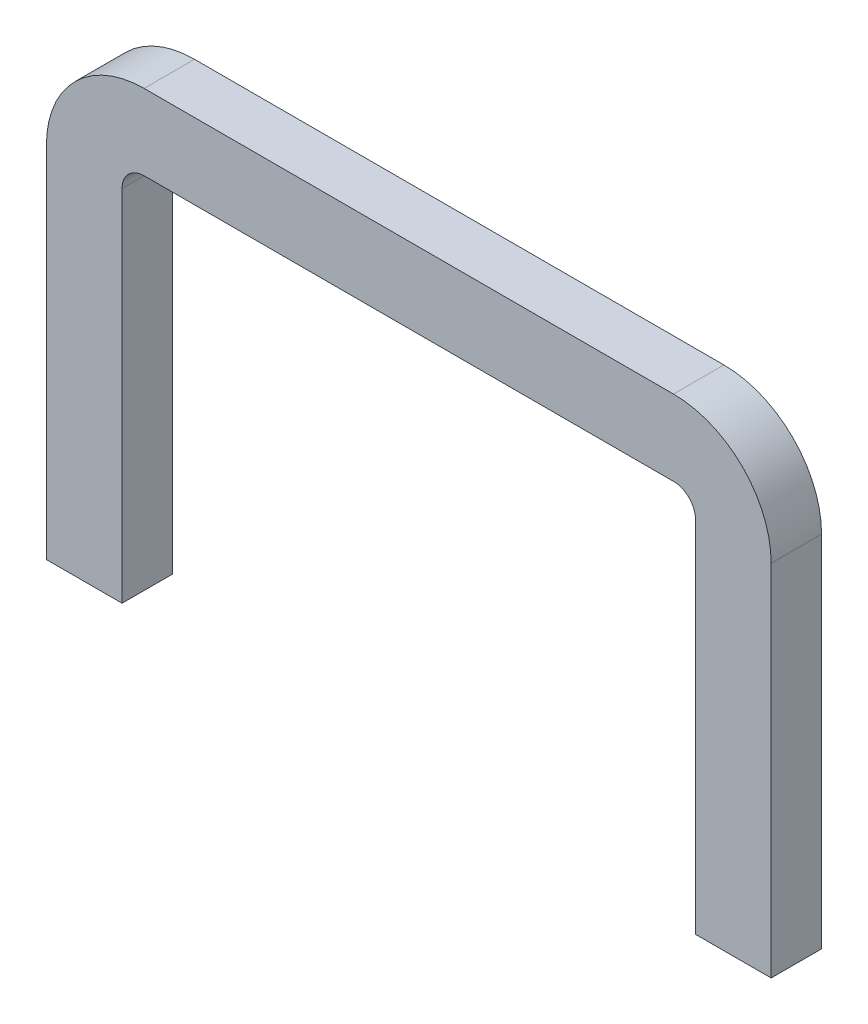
ISO-10303-21;
HEADER;
FILE_DESCRIPTION(('STEP AP214'),'2;1');
FILE_NAME('part.step','',(''),(''),'','','');
FILE_SCHEMA(('AUTOMOTIVE_DESIGN { 1 0 10303 214 1 1 1 1 }'));
ENDSEC;
DATA;
#1=APPLICATION_CONTEXT('core data for automotive mechanical design processes');
#2=APPLICATION_PROTOCOL_DEFINITION('international standard','automotive_design',2000,#1);
#3=PRODUCT_CONTEXT('',#1,'mechanical');
#4=PRODUCT('Part','Part','',(#3));
#5=PRODUCT_RELATED_PRODUCT_CATEGORY('part','',(#4));
#6=PRODUCT_DEFINITION_FORMATION('','',#4);
#7=PRODUCT_DEFINITION_CONTEXT('part definition',#1,'design');
#8=PRODUCT_DEFINITION('design','',#6,#7);
#9=PRODUCT_DEFINITION_SHAPE('','',#8);
#10=(LENGTH_UNIT() NAMED_UNIT(*) SI_UNIT(.MILLI.,.METRE.));
#11=(NAMED_UNIT(*) PLANE_ANGLE_UNIT() SI_UNIT($,.RADIAN.));
#12=(NAMED_UNIT(*) SI_UNIT($,.STERADIAN.) SOLID_ANGLE_UNIT());
#13=UNCERTAINTY_MEASURE_WITH_UNIT(LENGTH_MEASURE(1.E-05),#10,'distance_accuracy_value','');
#14=(GEOMETRIC_REPRESENTATION_CONTEXT(3) GLOBAL_UNCERTAINTY_ASSIGNED_CONTEXT((#13)) GLOBAL_UNIT_ASSIGNED_CONTEXT((#10,
#11,#12)) REPRESENTATION_CONTEXT('',''));
#15=CARTESIAN_POINT('',(0.,0.,0.));
#16=DIRECTION('',(0.,0.,1.));
#17=DIRECTION('',(1.,0.,0.));
#18=AXIS2_PLACEMENT_3D('',#15,#16,#17);
#19=CARTESIAN_POINT('',(57.5,-30.25,8.));
#20=DIRECTION('',(0.,1.,0.));
#21=DIRECTION('',(-1.,0.,0.));
#22=AXIS2_PLACEMENT_3D('',#19,#20,#21);
#23=PLANE('',#22);
#24=DIRECTION('',(1.,0.,0.));
#25=VECTOR('',#24,1.);
#26=CARTESIAN_POINT('',(57.5,-30.25,0.));
#27=LINE('',#26,#25);
#28=CARTESIAN_POINT('',(45.5,-30.25,0.));
#29=VERTEX_POINT('',#28);
#30=CARTESIAN_POINT('',(57.5,-30.25,0.));
#31=VERTEX_POINT('',#30);
#32=EDGE_CURVE('E151',#29,#31,#27,.T.);
#33=ORIENTED_EDGE('',*,*,#32,.T.);
#34=DIRECTION('',(0.,0.,-1.));
#35=VECTOR('',#34,1.);
#36=CARTESIAN_POINT('',(57.5,-30.25,8.));
#37=LINE('',#36,#35);
#38=CARTESIAN_POINT('',(57.5,-30.25,8.));
#39=VERTEX_POINT('',#38);
#40=EDGE_CURVE('E11',#39,#31,#37,.T.);
#41=ORIENTED_EDGE('',*,*,#40,.F.);
#42=DIRECTION('',(1.,0.,0.));
#43=VECTOR('',#42,1.);
#44=CARTESIAN_POINT('',(57.5,-30.25,8.));
#45=LINE('',#44,#43);
#46=CARTESIAN_POINT('',(45.5,-30.25,8.));
#47=VERTEX_POINT('',#46);
#48=EDGE_CURVE('E173',#47,#39,#45,.T.);
#49=ORIENTED_EDGE('',*,*,#48,.F.);
#50=DIRECTION('',(0.,0.,-1.));
#51=VECTOR('',#50,1.);
#52=CARTESIAN_POINT('',(45.5,-30.25,8.));
#53=LINE('',#52,#51);
#54=EDGE_CURVE('E147',#47,#29,#53,.T.);
#55=ORIENTED_EDGE('',*,*,#54,.T.);
#56=EDGE_LOOP('',(#33,#41,#49,#55));
#57=FACE_BOUND('',#56,.T.);
#58=ADVANCED_FACE('F31',(#57),#23,.F.);
#59=CARTESIAN_POINT('',(57.5,26.75,8.));
#60=DIRECTION('',(-1.,0.,0.));
#61=DIRECTION('',(0.,0.,1.));
#62=AXIS2_PLACEMENT_3D('',#59,#60,#61);
#63=PLANE('',#62);
#64=DIRECTION('',(0.,1.,0.));
#65=VECTOR('',#64,1.);
#66=CARTESIAN_POINT('',(57.5,26.75,0.));
#67=LINE('',#66,#65);
#68=CARTESIAN_POINT('',(57.5,26.75,0.));
#69=VERTEX_POINT('',#68);
#70=EDGE_CURVE('E154',#31,#69,#67,.T.);
#71=ORIENTED_EDGE('',*,*,#70,.T.);
#72=DIRECTION('',(0.,0.,-1.));
#73=VECTOR('',#72,1.);
#74=CARTESIAN_POINT('',(57.5,26.75,8.));
#75=LINE('',#74,#73);
#76=CARTESIAN_POINT('',(57.5,26.75,8.));
#77=VERTEX_POINT('',#76);
#78=EDGE_CURVE('E39',#77,#69,#75,.T.);
#79=ORIENTED_EDGE('',*,*,#78,.F.);
#80=DIRECTION('',(0.,1.,0.));
#81=VECTOR('',#80,1.);
#82=CARTESIAN_POINT('',(57.5,26.75,8.));
#83=LINE('',#82,#81);
#84=EDGE_CURVE('E102',#39,#77,#83,.T.);
#85=ORIENTED_EDGE('',*,*,#84,.F.);
#86=ORIENTED_EDGE('',*,*,#40,.T.);
#87=EDGE_LOOP('',(#71,#79,#85,#86));
#88=FACE_BOUND('',#87,.T.);
#89=ADVANCED_FACE('F251',(#88),#63,.F.);
#90=CARTESIAN_POINT('',(42.,26.75,8.));
#91=DIRECTION('',(0.,0.,-1.));
#92=DIRECTION('',(-1.,0.,0.));
#93=AXIS2_PLACEMENT_3D('',#90,#91,#92);
#94=CYLINDRICAL_SURFACE('',#93,15.5);
#95=CARTESIAN_POINT('',(42.,26.75,0.));
#96=DIRECTION('',(0.,0.,1.));
#97=DIRECTION('',(-1.,0.,0.));
#98=AXIS2_PLACEMENT_3D('',#95,#96,#97);
#99=CIRCLE('',#98,15.5);
#100=CARTESIAN_POINT('',(41.9999999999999,42.25,0.));
#101=VERTEX_POINT('',#100);
#102=EDGE_CURVE('E156',#69,#101,#99,.T.);
#103=ORIENTED_EDGE('',*,*,#102,.T.);
#104=DIRECTION('',(0.,0.,-1.));
#105=VECTOR('',#104,1.);
#106=CARTESIAN_POINT('',(41.9999999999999,42.25,8.));
#107=LINE('',#106,#105);
#108=CARTESIAN_POINT('',(41.9999999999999,42.25,8.));
#109=VERTEX_POINT('',#108);
#110=EDGE_CURVE('E192',#109,#101,#107,.T.);
#111=ORIENTED_EDGE('',*,*,#110,.F.);
#112=CARTESIAN_POINT('',(42.,26.75,8.));
#113=DIRECTION('',(0.,0.,1.));
#114=DIRECTION('',(-1.,0.,0.));
#115=AXIS2_PLACEMENT_3D('',#112,#113,#114);
#116=CIRCLE('',#115,15.5);
#117=EDGE_CURVE('E200',#77,#109,#116,.T.);
#118=ORIENTED_EDGE('',*,*,#117,.F.);
#119=ORIENTED_EDGE('',*,*,#78,.T.);
#120=EDGE_LOOP('',(#103,#111,#118,#119));
#121=FACE_BOUND('',#120,.T.);
#122=ADVANCED_FACE('F198',(#121),#94,.T.);
#123=CARTESIAN_POINT('',(-42.,42.25,8.));
#124=DIRECTION('',(0.,-1.,0.));
#125=DIRECTION('',(1.,0.,0.));
#126=AXIS2_PLACEMENT_3D('',#123,#124,#125);
#127=PLANE('',#126);
#128=DIRECTION('',(-1.,0.,0.));
#129=VECTOR('',#128,1.);
#130=CARTESIAN_POINT('',(-42.,42.25,0.));
#131=LINE('',#130,#129);
#132=CARTESIAN_POINT('',(-42.,42.25,0.));
#133=VERTEX_POINT('',#132);
#134=EDGE_CURVE('E158',#101,#133,#131,.T.);
#135=ORIENTED_EDGE('',*,*,#134,.T.);
#136=DIRECTION('',(0.,0.,-1.));
#137=VECTOR('',#136,1.);
#138=CARTESIAN_POINT('',(-42.,42.25,8.));
#139=LINE('',#138,#137);
#140=CARTESIAN_POINT('',(-42.,42.25,8.));
#141=VERTEX_POINT('',#140);
#142=EDGE_CURVE('E189',#141,#133,#139,.T.);
#143=ORIENTED_EDGE('',*,*,#142,.F.);
#144=DIRECTION('',(-1.,0.,0.));
#145=VECTOR('',#144,1.);
#146=CARTESIAN_POINT('',(-42.,42.25,8.));
#147=LINE('',#146,#145);
#148=EDGE_CURVE('E218',#109,#141,#147,.T.);
#149=ORIENTED_EDGE('',*,*,#148,.F.);
#150=ORIENTED_EDGE('',*,*,#110,.T.);
#151=EDGE_LOOP('',(#135,#143,#149,#150));
#152=FACE_BOUND('',#151,.T.);
#153=ADVANCED_FACE('F209',(#152),#127,.F.);
#154=CARTESIAN_POINT('',(-42.,26.75,8.));
#155=DIRECTION('',(0.,0.,-1.));
#156=DIRECTION('',(-1.,0.,0.));
#157=AXIS2_PLACEMENT_3D('',#154,#155,#156);
#158=CYLINDRICAL_SURFACE('',#157,15.5);
#159=CARTESIAN_POINT('',(-42.,26.75,0.));
#160=DIRECTION('',(0.,0.,1.));
#161=DIRECTION('',(1.,0.,0.));
#162=AXIS2_PLACEMENT_3D('',#159,#160,#161);
#163=CIRCLE('',#162,15.5);
#164=CARTESIAN_POINT('',(-57.5,26.7499999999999,0.));
#165=VERTEX_POINT('',#164);
#166=EDGE_CURVE('E160',#133,#165,#163,.T.);
#167=ORIENTED_EDGE('',*,*,#166,.T.);
#168=DIRECTION('',(0.,0.,-1.));
#169=VECTOR('',#168,1.);
#170=CARTESIAN_POINT('',(-57.5,26.7499999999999,8.));
#171=LINE('',#170,#169);
#172=CARTESIAN_POINT('',(-57.5,26.7499999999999,8.));
#173=VERTEX_POINT('',#172);
#174=EDGE_CURVE('E186',#173,#165,#171,.T.);
#175=ORIENTED_EDGE('',*,*,#174,.F.);
#176=CARTESIAN_POINT('',(-42.,26.75,8.));
#177=DIRECTION('',(0.,0.,1.));
#178=DIRECTION('',(1.,0.,0.));
#179=AXIS2_PLACEMENT_3D('',#176,#177,#178);
#180=CIRCLE('',#179,15.5);
#181=EDGE_CURVE('E215',#141,#173,#180,.T.);
#182=ORIENTED_EDGE('',*,*,#181,.F.);
#183=ORIENTED_EDGE('',*,*,#142,.T.);
#184=EDGE_LOOP('',(#167,#175,#182,#183));
#185=FACE_BOUND('',#184,.T.);
#186=ADVANCED_FACE('F213',(#185),#158,.T.);
#187=CARTESIAN_POINT('',(-57.5,26.7499999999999,8.));
#188=DIRECTION('',(1.,0.,0.));
#189=DIRECTION('',(0.,1.,0.));
#190=AXIS2_PLACEMENT_3D('',#187,#188,#189);
#191=PLANE('',#190);
#192=DIRECTION('',(0.,-1.,0.));
#193=VECTOR('',#192,1.);
#194=CARTESIAN_POINT('',(-57.5,26.7499999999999,0.));
#195=LINE('',#194,#193);
#196=CARTESIAN_POINT('',(-57.5,-30.25,0.));
#197=VERTEX_POINT('',#196);
#198=EDGE_CURVE('E162',#165,#197,#195,.T.);
#199=ORIENTED_EDGE('',*,*,#198,.T.);
#200=DIRECTION('',(0.,0.,-1.));
#201=VECTOR('',#200,1.);
#202=CARTESIAN_POINT('',(-57.5,-30.25,8.));
#203=LINE('',#202,#201);
#204=CARTESIAN_POINT('',(-57.5,-30.25,8.));
#205=VERTEX_POINT('',#204);
#206=EDGE_CURVE('E183',#205,#197,#203,.T.);
#207=ORIENTED_EDGE('',*,*,#206,.F.);
#208=DIRECTION('',(0.,-1.,0.));
#209=VECTOR('',#208,1.);
#210=CARTESIAN_POINT('',(-57.5,26.7499999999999,8.));
#211=LINE('',#210,#209);
#212=EDGE_CURVE('E217',#173,#205,#211,.T.);
#213=ORIENTED_EDGE('',*,*,#212,.F.);
#214=ORIENTED_EDGE('',*,*,#174,.T.);
#215=EDGE_LOOP('',(#199,#207,#213,#214));
#216=FACE_BOUND('',#215,.T.);
#217=ADVANCED_FACE('F264',(#216),#191,.F.);
#218=CARTESIAN_POINT('',(-57.5,-30.25,8.));
#219=DIRECTION('',(0.,1.,0.));
#220=DIRECTION('',(-1.,0.,0.));
#221=AXIS2_PLACEMENT_3D('',#218,#219,#220);
#222=PLANE('',#221);
#223=DIRECTION('',(1.,0.,0.));
#224=VECTOR('',#223,1.);
#225=CARTESIAN_POINT('',(-57.5,-30.25,0.));
#226=LINE('',#225,#224);
#227=CARTESIAN_POINT('',(-45.5,-30.25,0.));
#228=VERTEX_POINT('',#227);
#229=EDGE_CURVE('E164',#197,#228,#226,.T.);
#230=ORIENTED_EDGE('',*,*,#229,.T.);
#231=DIRECTION('',(0.,0.,-1.));
#232=VECTOR('',#231,1.);
#233=CARTESIAN_POINT('',(-45.5,-30.25,8.));
#234=LINE('',#233,#232);
#235=CARTESIAN_POINT('',(-45.5,-30.25,8.));
#236=VERTEX_POINT('',#235);
#237=EDGE_CURVE('E180',#236,#228,#234,.T.);
#238=ORIENTED_EDGE('',*,*,#237,.F.);
#239=DIRECTION('',(1.,0.,0.));
#240=VECTOR('',#239,1.);
#241=CARTESIAN_POINT('',(-57.5,-30.25,8.));
#242=LINE('',#241,#240);
#243=EDGE_CURVE('E220',#205,#236,#242,.T.);
#244=ORIENTED_EDGE('',*,*,#243,.F.);
#245=ORIENTED_EDGE('',*,*,#206,.T.);
#246=EDGE_LOOP('',(#230,#238,#244,#245));
#247=FACE_BOUND('',#246,.T.);
#248=ADVANCED_FACE('F267',(#247),#222,.F.);
#249=CARTESIAN_POINT('',(-45.5,26.75,8.));
#250=DIRECTION('',(-1.,0.,0.));
#251=DIRECTION('',(0.,-1.,0.));
#252=AXIS2_PLACEMENT_3D('',#249,#250,#251);
#253=PLANE('',#252);
#254=DIRECTION('',(0.,1.,0.));
#255=VECTOR('',#254,1.);
#256=CARTESIAN_POINT('',(-45.5,26.75,0.));
#257=LINE('',#256,#255);
#258=CARTESIAN_POINT('',(-45.5,26.75,0.));
#259=VERTEX_POINT('',#258);
#260=EDGE_CURVE('E166',#228,#259,#257,.T.);
#261=ORIENTED_EDGE('',*,*,#260,.T.);
#262=DIRECTION('',(0.,0.,-1.));
#263=VECTOR('',#262,1.);
#264=CARTESIAN_POINT('',(-45.5,26.75,8.));
#265=LINE('',#264,#263);
#266=CARTESIAN_POINT('',(-45.5,26.75,8.));
#267=VERTEX_POINT('',#266);
#268=EDGE_CURVE('E177',#267,#259,#265,.T.);
#269=ORIENTED_EDGE('',*,*,#268,.F.);
#270=DIRECTION('',(0.,1.,0.));
#271=VECTOR('',#270,1.);
#272=CARTESIAN_POINT('',(-45.5,26.75,8.));
#273=LINE('',#272,#271);
#274=EDGE_CURVE('E226',#236,#267,#273,.T.);
#275=ORIENTED_EDGE('',*,*,#274,.F.);
#276=ORIENTED_EDGE('',*,*,#237,.T.);
#277=EDGE_LOOP('',(#261,#269,#275,#276));
#278=FACE_BOUND('',#277,.T.);
#279=ADVANCED_FACE('F232',(#278),#253,.F.);
#280=CARTESIAN_POINT('',(-42.,26.75,8.));
#281=DIRECTION('',(0.,0.,-1.));
#282=DIRECTION('',(-1.,0.,0.));
#283=AXIS2_PLACEMENT_3D('',#280,#281,#282);
#284=CYLINDRICAL_SURFACE('',#283,3.5);
#285=CARTESIAN_POINT('',(-42.,26.75,0.));
#286=DIRECTION('',(0.,0.,-1.));
#287=DIRECTION('',(1.,0.,0.));
#288=AXIS2_PLACEMENT_3D('',#285,#286,#287);
#289=CIRCLE('',#288,3.5);
#290=CARTESIAN_POINT('',(-42.,30.25,0.));
#291=VERTEX_POINT('',#290);
#292=EDGE_CURVE('E168',#259,#291,#289,.T.);
#293=ORIENTED_EDGE('',*,*,#292,.T.);
#294=DIRECTION('',(0.,0.,-1.));
#295=VECTOR('',#294,1.);
#296=CARTESIAN_POINT('',(-42.,30.25,8.));
#297=LINE('',#296,#295);
#298=CARTESIAN_POINT('',(-42.,30.25,8.));
#299=VERTEX_POINT('',#298);
#300=EDGE_CURVE('E142',#299,#291,#297,.T.);
#301=ORIENTED_EDGE('',*,*,#300,.F.);
#302=CARTESIAN_POINT('',(-42.,26.75,8.));
#303=DIRECTION('',(0.,0.,-1.));
#304=DIRECTION('',(1.,0.,0.));
#305=AXIS2_PLACEMENT_3D('',#302,#303,#304);
#306=CIRCLE('',#305,3.5);
#307=EDGE_CURVE('E133',#267,#299,#306,.T.);
#308=ORIENTED_EDGE('',*,*,#307,.F.);
#309=ORIENTED_EDGE('',*,*,#268,.T.);
#310=EDGE_LOOP('',(#293,#301,#308,#309));
#311=FACE_BOUND('',#310,.T.);
#312=ADVANCED_FACE('F236',(#311),#284,.F.);
#313=CARTESIAN_POINT('',(-42.,30.25,8.));
#314=DIRECTION('',(0.,1.,0.));
#315=DIRECTION('',(0.,0.,1.));
#316=AXIS2_PLACEMENT_3D('',#313,#314,#315);
#317=PLANE('',#316);
#318=DIRECTION('',(1.,0.,0.));
#319=VECTOR('',#318,1.);
#320=CARTESIAN_POINT('',(-42.,30.25,0.));
#321=LINE('',#320,#319);
#322=CARTESIAN_POINT('',(42.,30.25,0.));
#323=VERTEX_POINT('',#322);
#324=EDGE_CURVE('E141',#291,#323,#321,.T.);
#325=ORIENTED_EDGE('',*,*,#324,.T.);
#326=DIRECTION('',(0.,0.,-1.));
#327=VECTOR('',#326,1.);
#328=CARTESIAN_POINT('',(42.,30.25,8.));
#329=LINE('',#328,#327);
#330=CARTESIAN_POINT('',(42.,30.25,8.));
#331=VERTEX_POINT('',#330);
#332=EDGE_CURVE('E138',#331,#323,#329,.T.);
#333=ORIENTED_EDGE('',*,*,#332,.F.);
#334=DIRECTION('',(1.,0.,0.));
#335=VECTOR('',#334,1.);
#336=CARTESIAN_POINT('',(-42.,30.25,8.));
#337=LINE('',#336,#335);
#338=EDGE_CURVE('E127',#299,#331,#337,.T.);
#339=ORIENTED_EDGE('',*,*,#338,.F.);
#340=ORIENTED_EDGE('',*,*,#300,.T.);
#341=EDGE_LOOP('',(#325,#333,#339,#340));
#342=FACE_BOUND('',#341,.T.);
#343=ADVANCED_FACE('F139',(#342),#317,.F.);
#344=CARTESIAN_POINT('',(42.,26.75,8.));
#345=DIRECTION('',(0.,0.,-1.));
#346=DIRECTION('',(-1.,0.,0.));
#347=AXIS2_PLACEMENT_3D('',#344,#345,#346);
#348=CYLINDRICAL_SURFACE('',#347,3.5);
#349=CARTESIAN_POINT('',(42.,26.75,0.));
#350=DIRECTION('',(0.,0.,-1.));
#351=DIRECTION('',(-1.,0.,0.));
#352=AXIS2_PLACEMENT_3D('',#349,#350,#351);
#353=CIRCLE('',#352,3.5);
#354=CARTESIAN_POINT('',(45.5,26.75,0.));
#355=VERTEX_POINT('',#354);
#356=EDGE_CURVE('E88',#323,#355,#353,.T.);
#357=ORIENTED_EDGE('',*,*,#356,.T.);
#358=DIRECTION('',(0.,0.,-1.));
#359=VECTOR('',#358,1.);
#360=CARTESIAN_POINT('',(45.5,26.75,8.));
#361=LINE('',#360,#359);
#362=CARTESIAN_POINT('',(45.5,26.75,8.));
#363=VERTEX_POINT('',#362);
#364=EDGE_CURVE('E143',#363,#355,#361,.T.);
#365=ORIENTED_EDGE('',*,*,#364,.F.);
#366=CARTESIAN_POINT('',(42.,26.75,8.));
#367=DIRECTION('',(0.,0.,-1.));
#368=DIRECTION('',(-1.,0.,0.));
#369=AXIS2_PLACEMENT_3D('',#366,#367,#368);
#370=CIRCLE('',#369,3.5);
#371=EDGE_CURVE('E131',#331,#363,#370,.T.);
#372=ORIENTED_EDGE('',*,*,#371,.F.);
#373=ORIENTED_EDGE('',*,*,#332,.T.);
#374=EDGE_LOOP('',(#357,#365,#372,#373));
#375=FACE_BOUND('',#374,.T.);
#376=ADVANCED_FACE('F145',(#375),#348,.F.);
#377=CARTESIAN_POINT('',(45.5,26.75,8.));
#378=DIRECTION('',(1.,0.,0.));
#379=DIRECTION('',(0.,1.,0.));
#380=AXIS2_PLACEMENT_3D('',#377,#378,#379);
#381=PLANE('',#380);
#382=DIRECTION('',(0.,-1.,0.));
#383=VECTOR('',#382,1.);
#384=CARTESIAN_POINT('',(45.5,26.75,0.));
#385=LINE('',#384,#383);
#386=EDGE_CURVE('E94',#355,#29,#385,.T.);
#387=ORIENTED_EDGE('',*,*,#386,.T.);
#388=ORIENTED_EDGE('',*,*,#54,.F.);
#389=DIRECTION('',(0.,-1.,0.));
#390=VECTOR('',#389,1.);
#391=CARTESIAN_POINT('',(45.5,26.75,8.));
#392=LINE('',#391,#390);
#393=EDGE_CURVE('E47',#363,#47,#392,.T.);
#394=ORIENTED_EDGE('',*,*,#393,.F.);
#395=ORIENTED_EDGE('',*,*,#364,.T.);
#396=EDGE_LOOP('',(#387,#388,#394,#395));
#397=FACE_BOUND('',#396,.T.);
#398=ADVANCED_FACE('F240',(#397),#381,.F.);
#399=CARTESIAN_POINT('',(42.,26.75,8.));
#400=DIRECTION('',(0.,0.,-1.));
#401=DIRECTION('',(-1.,0.,0.));
#402=AXIS2_PLACEMENT_3D('',#399,#400,#401);
#403=PLANE('',#402);
#404=ORIENTED_EDGE('',*,*,#48,.T.);
#405=ORIENTED_EDGE('',*,*,#84,.T.);
#406=ORIENTED_EDGE('',*,*,#117,.T.);
#407=ORIENTED_EDGE('',*,*,#148,.T.);
#408=ORIENTED_EDGE('',*,*,#181,.T.);
#409=ORIENTED_EDGE('',*,*,#212,.T.);
#410=ORIENTED_EDGE('',*,*,#243,.T.);
#411=ORIENTED_EDGE('',*,*,#274,.T.);
#412=ORIENTED_EDGE('',*,*,#307,.T.);
#413=ORIENTED_EDGE('',*,*,#338,.T.);
#414=ORIENTED_EDGE('',*,*,#371,.T.);
#415=ORIENTED_EDGE('',*,*,#393,.T.);
#416=EDGE_LOOP('',(#404,#405,#406,#407,#408,#409,#410,#411,#412,#413,#414,#415));
#417=FACE_BOUND('',#416,.T.);
#418=ADVANCED_FACE('F129',(#417),#403,.F.);
#419=CARTESIAN_POINT('',(42.,26.75,0.));
#420=DIRECTION('',(0.,0.,-1.));
#421=DIRECTION('',(-1.,0.,0.));
#422=AXIS2_PLACEMENT_3D('',#419,#420,#421);
#423=PLANE('',#422);
#424=ORIENTED_EDGE('',*,*,#32,.F.);
#425=ORIENTED_EDGE('',*,*,#386,.F.);
#426=ORIENTED_EDGE('',*,*,#356,.F.);
#427=ORIENTED_EDGE('',*,*,#324,.F.);
#428=ORIENTED_EDGE('',*,*,#292,.F.);
#429=ORIENTED_EDGE('',*,*,#260,.F.);
#430=ORIENTED_EDGE('',*,*,#229,.F.);
#431=ORIENTED_EDGE('',*,*,#198,.F.);
#432=ORIENTED_EDGE('',*,*,#166,.F.);
#433=ORIENTED_EDGE('',*,*,#134,.F.);
#434=ORIENTED_EDGE('',*,*,#102,.F.);
#435=ORIENTED_EDGE('',*,*,#70,.F.);
#436=EDGE_LOOP('',(#424,#425,#426,#427,#428,#429,#430,#431,#432,#433,#434,#435));
#437=FACE_BOUND('',#436,.T.);
#438=ADVANCED_FACE('F204',(#437),#423,.T.);
#439=CLOSED_SHELL('',(#58,#89,#122,#153,#186,#217,#248,#279,#312,#343,#376,#398,#418,#438));
#440=MANIFOLD_SOLID_BREP('B2',#439);
#441=ADVANCED_BREP_SHAPE_REPRESENTATION('',(#18,#440),#14);
#442=SHAPE_DEFINITION_REPRESENTATION(#9,#441);
ENDSEC;
END-ISO-10303-21;
